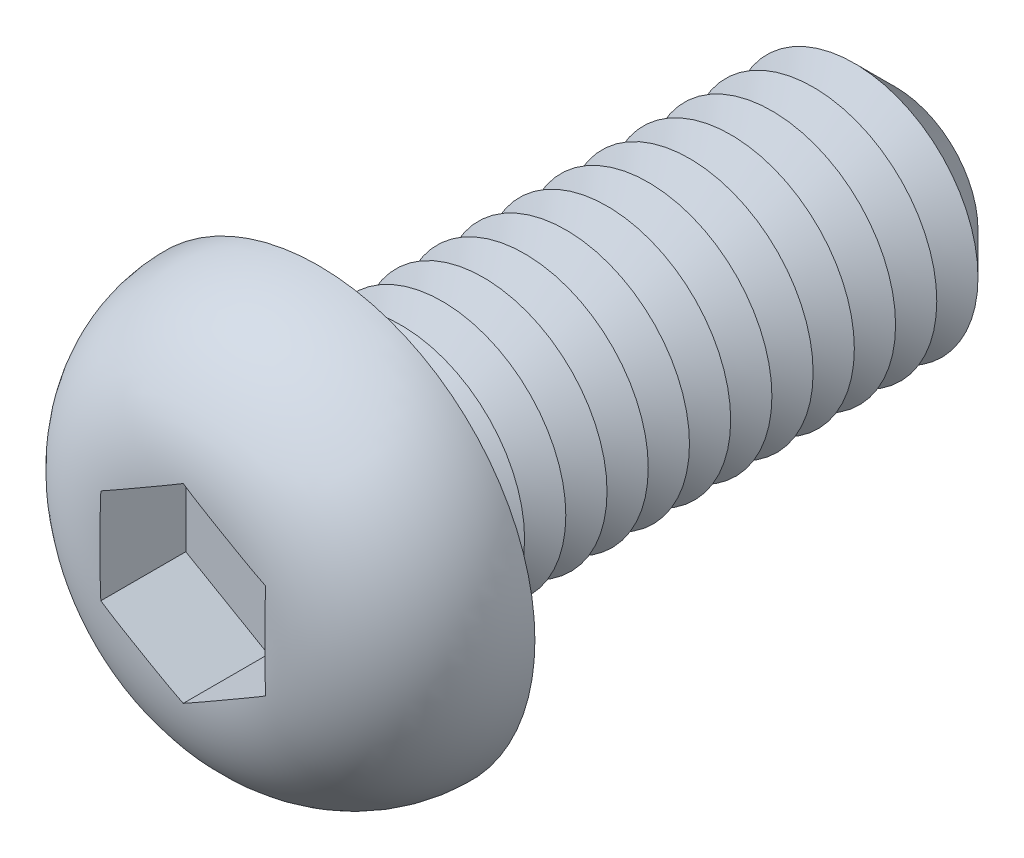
ISO-10303-21;
HEADER;
FILE_DESCRIPTION(('STEP AP214'),'2;1');
FILE_NAME('part.step','',(''),(''),'','','');
FILE_SCHEMA(('AUTOMOTIVE_DESIGN { 1 0 10303 214 1 1 1 1 }'));
ENDSEC;
DATA;
#1=APPLICATION_CONTEXT('core data for automotive mechanical design processes');
#2=APPLICATION_PROTOCOL_DEFINITION('international standard','automotive_design',2000,#1);
#3=PRODUCT_CONTEXT('',#1,'mechanical');
#4=PRODUCT('Part','Part','',(#3));
#5=PRODUCT_RELATED_PRODUCT_CATEGORY('part','',(#4));
#6=PRODUCT_DEFINITION_FORMATION('','',#4);
#7=PRODUCT_DEFINITION_CONTEXT('part definition',#1,'design');
#8=PRODUCT_DEFINITION('design','',#6,#7);
#9=PRODUCT_DEFINITION_SHAPE('','',#8);
#10=(LENGTH_UNIT() NAMED_UNIT(*) SI_UNIT(.MILLI.,.METRE.));
#11=(NAMED_UNIT(*) PLANE_ANGLE_UNIT() SI_UNIT($,.RADIAN.));
#12=(NAMED_UNIT(*) SI_UNIT($,.STERADIAN.) SOLID_ANGLE_UNIT());
#13=UNCERTAINTY_MEASURE_WITH_UNIT(LENGTH_MEASURE(1.E-05),#10,'distance_accuracy_value','');
#14=(GEOMETRIC_REPRESENTATION_CONTEXT(3) GLOBAL_UNCERTAINTY_ASSIGNED_CONTEXT((#13)) GLOBAL_UNIT_ASSIGNED_CONTEXT((#10,
#11,#12)) REPRESENTATION_CONTEXT('',''));
#15=CARTESIAN_POINT('',(0.,0.,0.));
#16=DIRECTION('',(0.,0.,1.));
#17=DIRECTION('',(1.,0.,0.));
#18=AXIS2_PLACEMENT_3D('',#15,#16,#17);
#19=CARTESIAN_POINT('',(0.,0.,-14.));
#20=DIRECTION('',(0.,0.,1.));
#21=DIRECTION('',(1.,0.,0.));
#22=AXIS2_PLACEMENT_3D('',#19,#20,#21);
#23=CYLINDRICAL_SURFACE('',#22,3.);
#24=CARTESIAN_POINT('',(0.,0.,-0.5));
#25=DIRECTION('',(0.,0.,1.));
#26=DIRECTION('',(1.,0.,0.));
#27=AXIS2_PLACEMENT_3D('',#24,#25,#26);
#28=CIRCLE('',#27,3.);
#29=CARTESIAN_POINT('',(3.,0.,-0.5));
#30=VERTEX_POINT('',#29);
#31=EDGE_CURVE('E48',#30,#30,#28,.F.);
#32=ORIENTED_EDGE('',*,*,#31,.T.);
#33=EDGE_LOOP('',(#32));
#34=FACE_BOUND('',#33,.T.);
#35=CARTESIAN_POINT('',(0.,0.,-1.));
#36=DIRECTION('',(0.,0.,1.));
#37=DIRECTION('',(1.,0.,0.));
#38=AXIS2_PLACEMENT_3D('',#35,#36,#37);
#39=CIRCLE('',#38,3.);
#40=CARTESIAN_POINT('',(3.,0.,-1.));
#41=VERTEX_POINT('',#40);
#42=EDGE_CURVE('E118',#41,#41,#39,.T.);
#43=ORIENTED_EDGE('',*,*,#42,.T.);
#44=EDGE_LOOP('',(#43));
#45=FACE_BOUND('',#44,.T.);
#46=ADVANCED_FACE('F39',(#34,#45),#23,.T.);
#47=CARTESIAN_POINT('',(0.,5.25,0.));
#48=DIRECTION('',(0.,0.,1.));
#49=DIRECTION('',(1.,0.,0.));
#50=AXIS2_PLACEMENT_3D('',#47,#48,#49);
#51=PLANE('',#50);
#52=CARTESIAN_POINT('',(0.,0.,0.));
#53=DIRECTION('',(0.,0.,1.));
#54=DIRECTION('',(1.,0.,0.));
#55=AXIS2_PLACEMENT_3D('',#52,#53,#54);
#56=CIRCLE('',#55,3.5);
#57=CARTESIAN_POINT('',(3.5,0.,0.));
#58=VERTEX_POINT('',#57);
#59=EDGE_CURVE('E11',#58,#58,#56,.T.);
#60=ORIENTED_EDGE('',*,*,#59,.T.);
#61=EDGE_LOOP('',(#60));
#62=FACE_BOUND('',#61,.T.);
#63=CARTESIAN_POINT('',(0.,0.,0.));
#64=DIRECTION('',(0.,0.,1.));
#65=DIRECTION('',(1.,0.,0.));
#66=AXIS2_PLACEMENT_3D('',#63,#64,#65);
#67=CIRCLE('',#66,5.25);
#68=CARTESIAN_POINT('',(5.25,0.,0.));
#69=VERTEX_POINT('',#68);
#70=EDGE_CURVE('E142',#69,#69,#67,.T.);
#71=ORIENTED_EDGE('',*,*,#70,.F.);
#72=EDGE_LOOP('',(#71));
#73=FACE_BOUND('',#72,.T.);
#74=ADVANCED_FACE('F219',(#62,#73),#51,.F.);
#75=CARTESIAN_POINT('',(0.,0.,0.));
#76=DIRECTION('',(0.,0.,1.));
#77=DIRECTION('',(1.,0.,0.));
#78=AXIS2_PLACEMENT_3D('',#75,#76,#77);
#79=DEGENERATE_TOROIDAL_SURFACE('',#78,1.95,3.3,.T.);
#80=CARTESIAN_POINT('',(-2.0002,1.15458506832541,3.28035788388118));
#81=CARTESIAN_POINT('',(-1.91691288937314,1.20267090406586,3.28561413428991));
#82=CARTESIAN_POINT('',(-1.83357497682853,1.25078607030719,3.2893341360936));
#83=CARTESIAN_POINT('',(-1.66686712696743,1.34703489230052,3.29467873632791));
#84=CARTESIAN_POINT('',(-1.58349720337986,1.39516854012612,3.29630387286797));
#85=CARTESIAN_POINT('',(-1.4167768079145,1.49142460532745,3.29843721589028));
#86=CARTESIAN_POINT('',(-1.33342633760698,1.53954702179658,3.29894575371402));
#87=CARTESIAN_POINT('',(-1.16671724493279,1.63579656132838,3.29953775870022));
#88=CARTESIAN_POINT('',(-1.0833586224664,1.68392368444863,3.29962119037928));
#89=CARTESIAN_POINT('',(-0.916641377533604,1.78017793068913,3.29962119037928));
#90=CARTESIAN_POINT('',(-0.833282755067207,1.82830505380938,3.29953775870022));
#91=CARTESIAN_POINT('',(-0.666573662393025,1.92455459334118,3.29894575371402));
#92=CARTESIAN_POINT('',(-0.5832231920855,1.97267700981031,3.29843721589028));
#93=CARTESIAN_POINT('',(-0.416502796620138,2.06893307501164,3.29630387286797));
#94=CARTESIAN_POINT('',(-0.333132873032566,2.11706672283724,3.29467873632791));
#95=CARTESIAN_POINT('',(-0.166425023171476,2.21331554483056,3.2893341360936));
#96=CARTESIAN_POINT('',(-0.083087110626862,2.2614307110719,3.28561413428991));
#97=CARTESIAN_POINT('',(0.000200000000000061,2.30951654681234,3.28035788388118));
#98=B_SPLINE_CURVE_WITH_KNOTS('',3,(#80,#81,#82,#83,#84,#85,#86,#87,#88,#89,#90,#91,#92,#93,#94,
#95,#96,#97),.UNSPECIFIED.,.F.,.F.,(4,2,2,2,2,2,2,2,4),(0.,0.288898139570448,0.577722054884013,
0.866460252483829,1.15522255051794,1.44398484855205,1.73272304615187,2.02154696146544,
2.31044510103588),.UNSPECIFIED.);
#99=CARTESIAN_POINT('',(-2.,1.15470053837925,3.28037053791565));
#100=VERTEX_POINT('',#99);
#101=CARTESIAN_POINT('',(0.,2.3094010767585,3.28037053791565));
#102=VERTEX_POINT('',#101);
#103=EDGE_CURVE('E159',#100,#102,#98,.T.);
#104=ORIENTED_EDGE('',*,*,#103,.T.);
#105=CARTESIAN_POINT('',(-0.000199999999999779,2.30951654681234,3.28035788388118));
#106=CARTESIAN_POINT('',(0.0830871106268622,2.2614307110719,3.28561413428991));
#107=CARTESIAN_POINT('',(0.166425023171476,2.21331554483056,3.2893341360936));
#108=CARTESIAN_POINT('',(0.333132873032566,2.11706672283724,3.29467873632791));
#109=CARTESIAN_POINT('',(0.416502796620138,2.06893307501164,3.29630387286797));
#110=CARTESIAN_POINT('',(0.5832231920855,1.97267700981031,3.29843721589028));
#111=CARTESIAN_POINT('',(0.666573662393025,1.92455459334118,3.29894575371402));
#112=CARTESIAN_POINT('',(0.833282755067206,1.82830505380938,3.29953775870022));
#113=CARTESIAN_POINT('',(0.916641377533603,1.78017793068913,3.29962119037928));
#114=CARTESIAN_POINT('',(1.0833586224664,1.68392368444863,3.29962119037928));
#115=CARTESIAN_POINT('',(1.16671724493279,1.63579656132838,3.29953775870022));
#116=CARTESIAN_POINT('',(1.33342633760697,1.53954702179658,3.29894575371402));
#117=CARTESIAN_POINT('',(1.4167768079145,1.49142460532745,3.29843721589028));
#118=CARTESIAN_POINT('',(1.58349720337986,1.39516854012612,3.29630387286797));
#119=CARTESIAN_POINT('',(1.66686712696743,1.34703489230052,3.29467873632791));
#120=CARTESIAN_POINT('',(1.83357497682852,1.25078607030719,3.2893341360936));
#121=CARTESIAN_POINT('',(1.91691288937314,1.20267090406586,3.28561413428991));
#122=CARTESIAN_POINT('',(2.0002,1.15458506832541,3.28035788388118));
#123=B_SPLINE_CURVE_WITH_KNOTS('',3,(#105,#106,#107,#108,#109,#110,#111,#112,#113,#114,#115,
#116,#117,#118,#119,#120,#121,#122),.UNSPECIFIED.,.F.,.F.,(4,2,2,2,2,2,2,2,4),(0.,
0.288898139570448,0.577722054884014,0.866460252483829,1.15522255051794,1.44398484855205,
1.73272304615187,2.02154696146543,2.31044510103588),.UNSPECIFIED.);
#124=CARTESIAN_POINT('',(2.,1.15470053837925,3.28037053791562));
#125=VERTEX_POINT('',#124);
#126=EDGE_CURVE('E98',#102,#125,#123,.T.);
#127=ORIENTED_EDGE('',*,*,#126,.T.);
#128=CARTESIAN_POINT('',(2.,0.,3.29962119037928));
#129=CARTESIAN_POINT('',(2.,-0.083776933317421,3.29962202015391));
#130=CARTESIAN_POINT('',(2.,-0.16755385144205,3.29955399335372));
#131=CARTESIAN_POINT('',(2.,-0.335108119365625,3.29913665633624));
#132=CARTESIAN_POINT('',(2.,-0.418885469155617,3.29878734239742));
#133=CARTESIAN_POINT('',(2.,-0.58647412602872,3.29739645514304));
#134=CARTESIAN_POINT('',(2.,-0.670285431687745,3.29635457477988));
#135=CARTESIAN_POINT('',(2.,-0.83788107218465,3.29299045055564));
#136=CARTESIAN_POINT('',(2.,-0.921665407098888,3.29066821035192));
#137=CARTESIAN_POINT('',(2.,-1.1722454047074,3.2807858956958));
#138=CARTESIAN_POINT('',(2.,-1.33895832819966,3.27031526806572));
#139=CARTESIAN_POINT('',(2.,-1.67103623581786,3.23635494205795));
#140=CARTESIAN_POINT('',(2.,-1.83640244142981,3.21287879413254));
#141=CARTESIAN_POINT('',(2.,-2.10344176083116,3.16074182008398));
#142=CARTESIAN_POINT('',(2.,-2.2061099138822,3.13718731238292));
#143=CARTESIAN_POINT('',(2.,-2.40948794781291,3.08263206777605));
#144=CARTESIAN_POINT('',(2.,-2.51019754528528,3.05163026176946));
#145=CARTESIAN_POINT('',(2.,-2.70894468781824,2.98167613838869));
#146=CARTESIAN_POINT('',(2.,-2.80697949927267,2.94271600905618));
#147=CARTESIAN_POINT('',(2.,-2.9994014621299,2.85662314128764));
#148=CARTESIAN_POINT('',(2.,-3.09378880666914,2.80949083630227));
#149=CARTESIAN_POINT('',(2.,-3.27874879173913,2.70660110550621));
#150=CARTESIAN_POINT('',(2.,-3.36928473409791,2.6507774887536));
#151=CARTESIAN_POINT('',(2.,-3.54476824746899,2.53095107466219));
#152=CARTESIAN_POINT('',(2.,-3.6297163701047,2.46694908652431));
#153=CARTESIAN_POINT('',(2.,-3.79309021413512,2.33110056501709));
#154=CARTESIAN_POINT('',(2.,-3.87151694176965,2.25925524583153));
#155=CARTESIAN_POINT('',(2.,-4.02093628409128,2.10826339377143));
#156=CARTESIAN_POINT('',(2.,-4.09192987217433,2.02911781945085));
#157=CARTESIAN_POINT('',(2.,-4.27732278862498,1.8003635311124));
#158=CARTESIAN_POINT('',(2.,-4.38297261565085,1.64348590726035));
#159=CARTESIAN_POINT('',(2.,-4.564185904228,1.31336862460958));
#160=CARTESIAN_POINT('',(2.,-4.63976443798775,1.14013721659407));
#161=CARTESIAN_POINT('',(2.,-4.75417820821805,0.794488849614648));
#162=CARTESIAN_POINT('',(2.,-4.79509243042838,0.622758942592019));
#163=CARTESIAN_POINT('',(2.,-4.84679751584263,0.274828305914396));
#164=CARTESIAN_POINT('',(2.,-4.85759267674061,0.098628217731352));
#165=CARTESIAN_POINT('',(2.,-4.8487955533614,-0.249157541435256));
#166=CARTESIAN_POINT('',(2.,-4.82985906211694,-0.420760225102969));
#167=CARTESIAN_POINT('',(2.,-4.76345103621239,-0.758322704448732));
#168=CARTESIAN_POINT('',(2.,-4.71598351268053,-0.924283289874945));
#169=CARTESIAN_POINT('',(2.,-4.59404942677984,-1.24604183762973));
#170=CARTESIAN_POINT('',(2.,-4.51956988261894,-1.40183487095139));
#171=CARTESIAN_POINT('',(2.,-4.34600859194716,-1.6990817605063));
#172=CARTESIAN_POINT('',(2.,-4.24691988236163,-1.84053154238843));
#173=CARTESIAN_POINT('',(2.,-4.02493220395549,-2.10847549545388));
#174=CARTESIAN_POINT('',(2.,-3.90156532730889,-2.23458080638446));
#175=CARTESIAN_POINT('',(2.,-3.63636218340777,-2.46550695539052));
#176=CARTESIAN_POINT('',(2.,-3.49453117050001,-2.57033382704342));
#177=CARTESIAN_POINT('',(2.,-3.26713798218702,-2.7130834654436));
#178=CARTESIAN_POINT('',(2.,-3.18660091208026,-2.75923686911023));
#179=CARTESIAN_POINT('',(2.,-3.02216370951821,-2.84520816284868));
#180=CARTESIAN_POINT('',(2.,-2.93826250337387,-2.88502400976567));
#181=CARTESIAN_POINT('',(2.,-2.76779132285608,-2.95832456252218));
#182=CARTESIAN_POINT('',(2.,-2.68122238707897,-2.99181169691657));
#183=CARTESIAN_POINT('',(2.,-2.50604626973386,-3.05263810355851));
#184=CARTESIAN_POINT('',(2.,-2.41744088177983,-3.07998257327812));
#185=CARTESIAN_POINT('',(2.,-2.20396420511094,-3.13835394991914));
#186=CARTESIAN_POINT('',(2.,-2.07835656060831,-3.16669536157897));
#187=CARTESIAN_POINT('',(2.,-1.82529007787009,-3.2134938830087));
#188=CARTESIAN_POINT('',(2.,-1.69783012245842,-3.23194474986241));
#189=CARTESIAN_POINT('',(2.,-1.44149598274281,-3.26083645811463));
#190=CARTESIAN_POINT('',(2.,-1.31261808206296,-3.27124272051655));
#191=CARTESIAN_POINT('',(2.,-1.05456848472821,-3.28623769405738));
#192=CARTESIAN_POINT('',(2.,-0.925396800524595,-3.29082664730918));
#193=CARTESIAN_POINT('',(2.,-0.665550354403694,-3.29674923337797));
#194=CARTESIAN_POINT('',(2.,-0.53487497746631,-3.29804579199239));
#195=CARTESIAN_POINT('',(2.,-0.273526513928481,-3.29947536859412));
#196=CARTESIAN_POINT('',(2.,-0.142853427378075,-3.29960842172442));
#197=CARTESIAN_POINT('',(2.,0.118243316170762,-3.29963281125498));
#198=CARTESIAN_POINT('',(2.,0.248666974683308,-3.29952460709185));
#199=CARTESIAN_POINT('',(2.,0.509509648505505,-3.29825409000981));
#200=CARTESIAN_POINT('',(2.,0.639928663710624,-3.29709183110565));
#201=CARTESIAN_POINT('',(2.,0.831730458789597,-3.29304171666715));
#202=CARTESIAN_POINT('',(2.,0.89313616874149,-3.29139197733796));
#203=CARTESIAN_POINT('',(2.,1.01591282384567,-3.28711504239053));
#204=CARTESIAN_POINT('',(2.,1.07728376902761,-3.28448784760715));
#205=CARTESIAN_POINT('',(2.,1.26131335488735,-3.27473407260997));
#206=CARTESIAN_POINT('',(2.,1.38388698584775,-3.2657353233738));
#207=CARTESIAN_POINT('',(2.,1.62750125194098,-3.24079239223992));
#208=CARTESIAN_POINT('',(2.,1.74854662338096,-3.22489680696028));
#209=CARTESIAN_POINT('',(2.,1.98924449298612,-3.18452451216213));
#210=CARTESIAN_POINT('',(2.,2.10889688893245,-3.16004717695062));
#211=CARTESIAN_POINT('',(2.,2.34827145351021,-3.10067973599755));
#212=CARTESIAN_POINT('',(2.,2.46794336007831,-3.06558373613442));
#213=CARTESIAN_POINT('',(2.,2.70350765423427,-2.98433995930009));
#214=CARTESIAN_POINT('',(2.,2.8194000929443,-2.9381923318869));
#215=CARTESIAN_POINT('',(2.,3.0462872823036,-2.83430045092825));
#216=CARTESIAN_POINT('',(2.,3.157267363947,-2.77652399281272));
#217=CARTESIAN_POINT('',(2.,3.37244069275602,-2.64945989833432));
#218=CARTESIAN_POINT('',(2.,3.47663511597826,-2.58017426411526));
#219=CARTESIAN_POINT('',(2.,3.66184410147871,-2.44158969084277));
#220=CARTESIAN_POINT('',(2.,3.74400419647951,-2.37381785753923));
#221=CARTESIAN_POINT('',(2.,3.90136233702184,-2.23063102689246));
#222=CARTESIAN_POINT('',(2.,3.9765614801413,-2.1552172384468));
#223=CARTESIAN_POINT('',(2.,4.11902811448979,-1.99742327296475));
#224=CARTESIAN_POINT('',(2.,4.18630715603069,-1.91505354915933));
#225=CARTESIAN_POINT('',(2.,4.31224227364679,-1.74401295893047));
#226=CARTESIAN_POINT('',(2.,4.37089943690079,-1.65534288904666));
#227=CARTESIAN_POINT('',(2.,4.51742320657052,-1.40720395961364));
#228=CARTESIAN_POINT('',(2.,4.59632371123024,-1.24230503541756));
#229=CARTESIAN_POINT('',(2.,4.72377654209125,-0.901269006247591));
#230=CARTESIAN_POINT('',(2.,4.77233626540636,-0.725134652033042));
#231=CARTESIAN_POINT('',(2.,4.83594291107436,-0.375162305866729));
#232=CARTESIAN_POINT('',(2.,4.85240855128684,-0.201581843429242));
#233=CARTESIAN_POINT('',(2.,4.85558073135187,0.145835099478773));
#234=CARTESIAN_POINT('',(2.,4.8422910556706,0.319671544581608));
#235=CARTESIAN_POINT('',(2.,4.78674180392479,0.660539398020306));
#236=CARTESIAN_POINT('',(2.,4.74482430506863,0.827626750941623));
#237=CARTESIAN_POINT('',(2.,4.63375789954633,1.15246461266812));
#238=CARTESIAN_POINT('',(2.,4.56461058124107,1.31021566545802));
#239=CARTESIAN_POINT('',(2.,4.40063624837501,1.61344814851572));
#240=CARTESIAN_POINT('',(2.,4.30559842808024,1.75881539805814));
#241=CARTESIAN_POINT('',(2.,4.09315528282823,2.03216183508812));
#242=CARTESIAN_POINT('',(2.,3.97574503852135,2.16013718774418));
#243=CARTESIAN_POINT('',(2.,3.71810418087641,2.3997527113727));
#244=CARTESIAN_POINT('',(2.,3.57725563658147,2.51072635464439));
#245=CARTESIAN_POINT('',(2.,3.28005668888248,2.70933274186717));
#246=CARTESIAN_POINT('',(2.,3.12370896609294,2.79696951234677));
#247=CARTESIAN_POINT('',(2.,2.85462284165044,2.92305372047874));
#248=CARTESIAN_POINT('',(2.,2.74490899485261,2.96813077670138));
#249=CARTESIAN_POINT('',(2.,2.52184151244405,3.04824715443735));
#250=CARTESIAN_POINT('',(2.,2.40848685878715,3.08328364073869));
#251=CARTESIAN_POINT('',(2.,2.17918323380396,3.14397693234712));
#252=CARTESIAN_POINT('',(2.,2.06323128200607,3.16962230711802));
#253=CARTESIAN_POINT('',(2.,1.82982653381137,3.21251895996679));
#254=CARTESIAN_POINT('',(2.,1.71237385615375,3.229770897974));
#255=CARTESIAN_POINT('',(2.,1.46252543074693,3.2589582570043));
#256=CARTESIAN_POINT('',(2.,1.3300298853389,3.27000580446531));
#257=CARTESIAN_POINT('',(2.,1.0646774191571,3.28585371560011));
#258=CARTESIAN_POINT('',(2.,0.931820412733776,3.29065244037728));
#259=CARTESIAN_POINT('',(2.,0.665789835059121,3.29677132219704));
#260=CARTESIAN_POINT('',(2.,0.532616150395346,3.29808470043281));
#261=CARTESIAN_POINT('',(2.,0.332868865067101,3.29913679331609));
#262=CARTESIAN_POINT('',(2.,0.266295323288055,3.2993345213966));
#263=CARTESIAN_POINT('',(2.,0.133147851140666,3.29957639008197));
#264=CARTESIAN_POINT('',(2.,0.0665739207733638,3.29962053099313));
#265=CARTESIAN_POINT('',(2.,0.,3.29962119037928));
#266=B_SPLINE_CURVE_WITH_KNOTS('',3,(#128,#129,#130,#131,#132,#133,#134,#135,#136,#137,#138,
#139,#140,#141,#142,#143,#144,#145,#146,#147,#148,#149,#150,#151,#152,#153,#154,#155,#156,#157,
#158,#159,#160,#161,#162,#163,#164,#165,#166,#167,#168,#169,#170,#171,#172,#173,#174,#175,#176,
#177,#178,#179,#180,#181,#182,#183,#184,#185,#186,#187,#188,#189,#190,#191,#192,#193,#194,#195,
#196,#197,#198,#199,#200,#201,#202,#203,#204,#205,#206,#207,#208,#209,#210,#211,#212,#213,#214,
#215,#216,#217,#218,#219,#220,#221,#222,#223,#224,#225,#226,#227,#228,#229,#230,#231,#232,#233,
#234,#235,#236,#237,#238,#239,#240,#241,#242,#243,#244,#245,#246,#247,#248,#249,#250,#251,#252,
#253,#254,#255,#256,#257,#258,#259,#260,#261,#262,#263,#264,#265),.UNSPECIFIED.,.T.,.F.,(4,2,2,
2,2,2,2,2,2,2,2,2,2,2,2,2,2,2,2,2,2,2,2,2,2,2,2,2,2,2,2,2,2,2,2,2,2,2,2,2,2,2,2,2,2,2,2,2,2,2,2,
2,2,2,2,2,2,2,2,2,2,2,2,2,2,2,2,2,4),(0.,0.251330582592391,0.502664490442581,0.754109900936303,
1.00555459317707,1.50637447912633,2.00667353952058,2.32243701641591,2.63824585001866,
2.95436618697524,3.27046976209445,3.58911045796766,3.90771965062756,4.22627959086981,
4.5447977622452,5.10896009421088,5.67283930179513,6.19985685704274,6.72679920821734,
7.24228104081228,7.75769041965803,8.27334782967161,8.78915130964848,9.3160918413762,
9.84288274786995,10.1211212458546,10.3994492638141,10.6776702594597,10.9556549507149,
11.3414617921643,11.727511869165,12.1152122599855,12.5028965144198,12.8949273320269,
13.2869463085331,13.6782193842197,14.0694724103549,14.2537488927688,14.4380252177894,
14.8065831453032,15.1725852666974,15.5386140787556,15.9122523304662,16.28588552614,
16.6605680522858,17.0351854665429,17.3542226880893,17.6732095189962,17.9917252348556,
18.3102007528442,18.8555909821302,19.4008481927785,19.9214008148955,20.4418872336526,
20.9562606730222,21.4706041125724,21.9892675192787,22.5080451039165,23.0436926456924,
23.5792477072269,23.9346277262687,24.2901079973,24.6460195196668,25.0019030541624,
25.4005476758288,25.7992968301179,26.1988209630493,26.3985429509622,26.5982645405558),.UNSPECIFIED.);
#267=CARTESIAN_POINT('',(2.,-1.15470053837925,3.28037053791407));
#268=VERTEX_POINT('',#267);
#269=EDGE_CURVE('E63',#125,#268,#266,.T.);
#270=ORIENTED_EDGE('',*,*,#269,.T.);
#271=CARTESIAN_POINT('',(2.0002,-1.15458506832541,3.28035788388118));
#272=CARTESIAN_POINT('',(1.91691288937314,-1.20267090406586,3.28561413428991));
#273=CARTESIAN_POINT('',(1.83357497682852,-1.25078607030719,3.2893341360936));
#274=CARTESIAN_POINT('',(1.66686712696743,-1.34703489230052,3.29467873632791));
#275=CARTESIAN_POINT('',(1.58349720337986,-1.39516854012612,3.29630387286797));
#276=CARTESIAN_POINT('',(1.4167768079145,-1.49142460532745,3.29843721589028));
#277=CARTESIAN_POINT('',(1.33342633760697,-1.53954702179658,3.29894575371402));
#278=CARTESIAN_POINT('',(1.16671724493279,-1.63579656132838,3.29953775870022));
#279=CARTESIAN_POINT('',(1.0833586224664,-1.68392368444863,3.29962119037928));
#280=CARTESIAN_POINT('',(0.916641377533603,-1.78017793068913,3.29962119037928));
#281=CARTESIAN_POINT('',(0.833282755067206,-1.82830505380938,3.29953775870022));
#282=CARTESIAN_POINT('',(0.666573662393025,-1.92455459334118,3.29894575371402));
#283=CARTESIAN_POINT('',(0.5832231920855,-1.97267700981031,3.29843721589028));
#284=CARTESIAN_POINT('',(0.416502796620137,-2.06893307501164,3.29630387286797));
#285=CARTESIAN_POINT('',(0.333132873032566,-2.11706672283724,3.29467873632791));
#286=CARTESIAN_POINT('',(0.166425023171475,-2.21331554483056,3.2893341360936));
#287=CARTESIAN_POINT('',(0.0830871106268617,-2.2614307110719,3.28561413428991));
#288=CARTESIAN_POINT('',(-0.000200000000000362,-2.30951654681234,3.28035788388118));
#289=B_SPLINE_CURVE_WITH_KNOTS('',3,(#271,#272,#273,#274,#275,#276,#277,#278,#279,#280,#281,
#282,#283,#284,#285,#286,#287,#288),.UNSPECIFIED.,.F.,.F.,(4,2,2,2,2,2,2,2,4),(0.,
0.288898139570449,0.577722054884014,0.86646025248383,1.15522255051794,1.44398484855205,
1.73272304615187,2.02154696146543,2.31044510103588),.UNSPECIFIED.);
#290=CARTESIAN_POINT('',(0.,-2.3094010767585,3.28037053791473));
#291=VERTEX_POINT('',#290);
#292=EDGE_CURVE('E240',#268,#291,#289,.T.);
#293=ORIENTED_EDGE('',*,*,#292,.T.);
#294=CARTESIAN_POINT('',(0.000199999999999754,-2.30951654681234,3.28035788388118));
#295=CARTESIAN_POINT('',(-0.0830871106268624,-2.2614307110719,3.28561413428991));
#296=CARTESIAN_POINT('',(-0.166425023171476,-2.21331554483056,3.2893341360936));
#297=CARTESIAN_POINT('',(-0.333132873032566,-2.11706672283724,3.29467873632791));
#298=CARTESIAN_POINT('',(-0.416502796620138,-2.06893307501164,3.29630387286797));
#299=CARTESIAN_POINT('',(-0.5832231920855,-1.97267700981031,3.29843721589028));
#300=CARTESIAN_POINT('',(-0.666573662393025,-1.92455459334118,3.29894575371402));
#301=CARTESIAN_POINT('',(-0.833282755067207,-1.82830505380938,3.29953775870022));
#302=CARTESIAN_POINT('',(-0.916641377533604,-1.78017793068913,3.29962119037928));
#303=CARTESIAN_POINT('',(-1.0833586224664,-1.68392368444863,3.29962119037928));
#304=CARTESIAN_POINT('',(-1.16671724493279,-1.63579656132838,3.29953775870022));
#305=CARTESIAN_POINT('',(-1.33342633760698,-1.53954702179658,3.29894575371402));
#306=CARTESIAN_POINT('',(-1.4167768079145,-1.49142460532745,3.29843721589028));
#307=CARTESIAN_POINT('',(-1.58349720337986,-1.39516854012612,3.29630387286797));
#308=CARTESIAN_POINT('',(-1.66686712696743,-1.34703489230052,3.29467873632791));
#309=CARTESIAN_POINT('',(-1.83357497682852,-1.25078607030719,3.2893341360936));
#310=CARTESIAN_POINT('',(-1.91691288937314,-1.20267090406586,3.28561413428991));
#311=CARTESIAN_POINT('',(-2.0002,-1.15458506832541,3.28035788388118));
#312=B_SPLINE_CURVE_WITH_KNOTS('',3,(#294,#295,#296,#297,#298,#299,#300,#301,#302,#303,#304,
#305,#306,#307,#308,#309,#310,#311),.UNSPECIFIED.,.F.,.F.,(4,2,2,2,2,2,2,2,4),(0.,
0.288898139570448,0.577722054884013,0.866460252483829,1.15522255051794,1.44398484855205,
1.73272304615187,2.02154696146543,2.31044510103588),.UNSPECIFIED.);
#313=CARTESIAN_POINT('',(-2.,-1.15470053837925,3.28037053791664));
#314=VERTEX_POINT('',#313);
#315=EDGE_CURVE('E246',#291,#314,#312,.T.);
#316=ORIENTED_EDGE('',*,*,#315,.T.);
#317=CARTESIAN_POINT('',(-2.,0.,3.29962119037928));
#318=CARTESIAN_POINT('',(-2.,0.083776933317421,3.29962202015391));
#319=CARTESIAN_POINT('',(-2.,0.16755385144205,3.29955399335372));
#320=CARTESIAN_POINT('',(-2.,0.335108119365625,3.29913665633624));
#321=CARTESIAN_POINT('',(-2.,0.418885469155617,3.29878734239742));
#322=CARTESIAN_POINT('',(-2.,0.58647412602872,3.29739645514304));
#323=CARTESIAN_POINT('',(-2.,0.670285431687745,3.29635457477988));
#324=CARTESIAN_POINT('',(-2.,0.83788107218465,3.29299045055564));
#325=CARTESIAN_POINT('',(-2.,0.921665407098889,3.29066821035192));
#326=CARTESIAN_POINT('',(-2.,1.1722454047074,3.2807858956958));
#327=CARTESIAN_POINT('',(-2.,1.33895832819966,3.27031526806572));
#328=CARTESIAN_POINT('',(-2.,1.67103623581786,3.23635494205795));
#329=CARTESIAN_POINT('',(-2.,1.83640244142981,3.21287879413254));
#330=CARTESIAN_POINT('',(-2.,2.10344176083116,3.16074182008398));
#331=CARTESIAN_POINT('',(-2.,2.2061099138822,3.13718731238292));
#332=CARTESIAN_POINT('',(-2.,2.40948794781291,3.08263206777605));
#333=CARTESIAN_POINT('',(-2.,2.51019754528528,3.05163026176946));
#334=CARTESIAN_POINT('',(-2.,2.70894468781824,2.98167613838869));
#335=CARTESIAN_POINT('',(-2.,2.80697949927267,2.94271600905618));
#336=CARTESIAN_POINT('',(-2.,2.9994014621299,2.85662314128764));
#337=CARTESIAN_POINT('',(-2.,3.09378880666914,2.80949083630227));
#338=CARTESIAN_POINT('',(-2.,3.27874879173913,2.70660110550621));
#339=CARTESIAN_POINT('',(-2.,3.36928473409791,2.6507774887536));
#340=CARTESIAN_POINT('',(-2.,3.54476824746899,2.53095107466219));
#341=CARTESIAN_POINT('',(-2.,3.6297163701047,2.46694908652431));
#342=CARTESIAN_POINT('',(-2.,3.79309021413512,2.33110056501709));
#343=CARTESIAN_POINT('',(-2.,3.87151694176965,2.25925524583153));
#344=CARTESIAN_POINT('',(-2.,4.02093628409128,2.10826339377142));
#345=CARTESIAN_POINT('',(-2.,4.09192987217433,2.02911781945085));
#346=CARTESIAN_POINT('',(-2.,4.27732278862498,1.8003635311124));
#347=CARTESIAN_POINT('',(-2.,4.38297261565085,1.64348590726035));
#348=CARTESIAN_POINT('',(-2.,4.564185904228,1.31336862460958));
#349=CARTESIAN_POINT('',(-2.,4.63976443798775,1.14013721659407));
#350=CARTESIAN_POINT('',(-2.,4.75417820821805,0.794488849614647));
#351=CARTESIAN_POINT('',(-2.,4.79509243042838,0.622758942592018));
#352=CARTESIAN_POINT('',(-2.,4.84679751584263,0.274828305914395));
#353=CARTESIAN_POINT('',(-2.,4.85759267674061,0.0986282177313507));
#354=CARTESIAN_POINT('',(-2.,4.8487955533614,-0.249157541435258));
#355=CARTESIAN_POINT('',(-2.,4.82985906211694,-0.42076022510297));
#356=CARTESIAN_POINT('',(-2.,4.76345103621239,-0.758322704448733));
#357=CARTESIAN_POINT('',(-2.,4.71598351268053,-0.924283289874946));
#358=CARTESIAN_POINT('',(-2.,4.59404942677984,-1.24604183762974));
#359=CARTESIAN_POINT('',(-2.,4.51956988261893,-1.40183487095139));
#360=CARTESIAN_POINT('',(-2.,4.34600859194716,-1.6990817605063));
#361=CARTESIAN_POINT('',(-2.,4.24691988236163,-1.84053154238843));
#362=CARTESIAN_POINT('',(-2.,4.02493220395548,-2.10847549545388));
#363=CARTESIAN_POINT('',(-2.,3.90156532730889,-2.23458080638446));
#364=CARTESIAN_POINT('',(-2.,3.63636218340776,-2.46550695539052));
#365=CARTESIAN_POINT('',(-2.,3.49453117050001,-2.57033382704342));
#366=CARTESIAN_POINT('',(-2.,3.26713798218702,-2.7130834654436));
#367=CARTESIAN_POINT('',(-2.,3.18660091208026,-2.75923686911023));
#368=CARTESIAN_POINT('',(-2.,3.02216370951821,-2.84520816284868));
#369=CARTESIAN_POINT('',(-2.,2.93826250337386,-2.88502400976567));
#370=CARTESIAN_POINT('',(-2.,2.76779132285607,-2.95832456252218));
#371=CARTESIAN_POINT('',(-2.,2.68122238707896,-2.99181169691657));
#372=CARTESIAN_POINT('',(-2.,2.50604626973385,-3.05263810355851));
#373=CARTESIAN_POINT('',(-2.,2.41744088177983,-3.07998257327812));
#374=CARTESIAN_POINT('',(-2.,2.20396420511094,-3.13835394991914));
#375=CARTESIAN_POINT('',(-2.,2.0783565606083,-3.16669536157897));
#376=CARTESIAN_POINT('',(-2.,1.82529007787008,-3.2134938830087));
#377=CARTESIAN_POINT('',(-2.,1.69783012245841,-3.23194474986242));
#378=CARTESIAN_POINT('',(-2.,1.4414959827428,-3.26083645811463));
#379=CARTESIAN_POINT('',(-2.,1.31261808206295,-3.27124272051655));
#380=CARTESIAN_POINT('',(-2.,1.0545684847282,-3.28623769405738));
#381=CARTESIAN_POINT('',(-2.,0.925396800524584,-3.29082664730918));
#382=CARTESIAN_POINT('',(-2.,0.665550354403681,-3.29674923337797));
#383=CARTESIAN_POINT('',(-2.,0.534874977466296,-3.29804579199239));
#384=CARTESIAN_POINT('',(-2.,0.273526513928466,-3.29947536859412));
#385=CARTESIAN_POINT('',(-2.,0.142853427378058,-3.29960842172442));
#386=CARTESIAN_POINT('',(-2.,-0.11824331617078,-3.29963281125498));
#387=CARTESIAN_POINT('',(-2.,-0.248666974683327,-3.29952460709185));
#388=CARTESIAN_POINT('',(-2.,-0.509509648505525,-3.29825409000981));
#389=CARTESIAN_POINT('',(-2.,-0.639928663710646,-3.29709183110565));
#390=CARTESIAN_POINT('',(-2.,-0.83173045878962,-3.29304171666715));
#391=CARTESIAN_POINT('',(-2.,-0.893136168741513,-3.29139197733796));
#392=CARTESIAN_POINT('',(-2.,-1.0159128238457,-3.28711504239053));
#393=CARTESIAN_POINT('',(-2.,-1.07728376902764,-3.28448784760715));
#394=CARTESIAN_POINT('',(-2.,-1.26131335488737,-3.27473407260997));
#395=CARTESIAN_POINT('',(-2.,-1.38388698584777,-3.2657353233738));
#396=CARTESIAN_POINT('',(-2.,-1.627501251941,-3.24079239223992));
#397=CARTESIAN_POINT('',(-2.,-1.74854662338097,-3.22489680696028));
#398=CARTESIAN_POINT('',(-2.,-1.98924449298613,-3.18452451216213));
#399=CARTESIAN_POINT('',(-2.,-2.10889688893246,-3.16004717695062));
#400=CARTESIAN_POINT('',(-2.,-2.34827145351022,-3.10067973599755));
#401=CARTESIAN_POINT('',(-2.,-2.46794336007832,-3.06558373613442));
#402=CARTESIAN_POINT('',(-2.,-2.70350765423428,-2.98433995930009));
#403=CARTESIAN_POINT('',(-2.,-2.81940009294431,-2.93819233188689));
#404=CARTESIAN_POINT('',(-2.,-3.0462872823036,-2.83430045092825));
#405=CARTESIAN_POINT('',(-2.,-3.157267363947,-2.77652399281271));
#406=CARTESIAN_POINT('',(-2.,-3.37244069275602,-2.64945989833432));
#407=CARTESIAN_POINT('',(-2.,-3.47663511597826,-2.58017426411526));
#408=CARTESIAN_POINT('',(-2.,-3.66184410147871,-2.44158969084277));
#409=CARTESIAN_POINT('',(-2.,-3.74400419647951,-2.37381785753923));
#410=CARTESIAN_POINT('',(-2.,-3.90136233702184,-2.23063102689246));
#411=CARTESIAN_POINT('',(-2.,-3.9765614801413,-2.1552172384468));
#412=CARTESIAN_POINT('',(-2.,-4.11902811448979,-1.99742327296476));
#413=CARTESIAN_POINT('',(-2.,-4.18630715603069,-1.91505354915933));
#414=CARTESIAN_POINT('',(-2.,-4.31224227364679,-1.74401295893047));
#415=CARTESIAN_POINT('',(-2.,-4.37089943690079,-1.65534288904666));
#416=CARTESIAN_POINT('',(-2.,-4.51742320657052,-1.40720395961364));
#417=CARTESIAN_POINT('',(-2.,-4.59632371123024,-1.24230503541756));
#418=CARTESIAN_POINT('',(-2.,-4.72377654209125,-0.901269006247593));
#419=CARTESIAN_POINT('',(-2.,-4.77233626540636,-0.725134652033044));
#420=CARTESIAN_POINT('',(-2.,-4.83594291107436,-0.37516230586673));
#421=CARTESIAN_POINT('',(-2.,-4.85240855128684,-0.201581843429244));
#422=CARTESIAN_POINT('',(-2.,-4.85558073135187,0.145835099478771));
#423=CARTESIAN_POINT('',(-2.,-4.8422910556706,0.319671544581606));
#424=CARTESIAN_POINT('',(-2.,-4.78674180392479,0.660539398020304));
#425=CARTESIAN_POINT('',(-2.,-4.74482430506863,0.827626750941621));
#426=CARTESIAN_POINT('',(-2.,-4.63375789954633,1.15246461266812));
#427=CARTESIAN_POINT('',(-2.,-4.56461058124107,1.31021566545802));
#428=CARTESIAN_POINT('',(-2.,-4.40063624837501,1.61344814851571));
#429=CARTESIAN_POINT('',(-2.,-4.30559842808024,1.75881539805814));
#430=CARTESIAN_POINT('',(-2.,-4.09315528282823,2.03216183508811));
#431=CARTESIAN_POINT('',(-2.,-3.97574503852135,2.16013718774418));
#432=CARTESIAN_POINT('',(-2.,-3.71810418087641,2.39975271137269));
#433=CARTESIAN_POINT('',(-2.,-3.57725563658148,2.51072635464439));
#434=CARTESIAN_POINT('',(-2.,-3.28005668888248,2.70933274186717));
#435=CARTESIAN_POINT('',(-2.,-3.12370896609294,2.79696951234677));
#436=CARTESIAN_POINT('',(-2.,-2.85462284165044,2.92305372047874));
#437=CARTESIAN_POINT('',(-2.,-2.74490899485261,2.96813077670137));
#438=CARTESIAN_POINT('',(-2.,-2.52184151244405,3.04824715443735));
#439=CARTESIAN_POINT('',(-2.,-2.40848685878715,3.08328364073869));
#440=CARTESIAN_POINT('',(-2.,-2.17918323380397,3.14397693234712));
#441=CARTESIAN_POINT('',(-2.,-2.06323128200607,3.16962230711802));
#442=CARTESIAN_POINT('',(-2.,-1.82982653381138,3.21251895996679));
#443=CARTESIAN_POINT('',(-2.,-1.71237385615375,3.229770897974));
#444=CARTESIAN_POINT('',(-2.,-1.46252543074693,3.2589582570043));
#445=CARTESIAN_POINT('',(-2.,-1.33002988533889,3.27000580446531));
#446=CARTESIAN_POINT('',(-2.,-1.0646774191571,3.28585371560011));
#447=CARTESIAN_POINT('',(-2.,-0.931820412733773,3.29065244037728));
#448=CARTESIAN_POINT('',(-2.,-0.66578983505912,3.29677132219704));
#449=CARTESIAN_POINT('',(-2.,-0.532616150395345,3.29808470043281));
#450=CARTESIAN_POINT('',(-2.,-0.332868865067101,3.29913679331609));
#451=CARTESIAN_POINT('',(-2.,-0.266295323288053,3.2993345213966));
#452=CARTESIAN_POINT('',(-2.,-0.133147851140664,3.29957639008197));
#453=CARTESIAN_POINT('',(-2.,-0.0665739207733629,3.29962053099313));
#454=CARTESIAN_POINT('',(-2.,0.,3.29962119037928));
#455=B_SPLINE_CURVE_WITH_KNOTS('',3,(#317,#318,#319,#320,#321,#322,#323,#324,#325,#326,#327,
#328,#329,#330,#331,#332,#333,#334,#335,#336,#337,#338,#339,#340,#341,#342,#343,#344,#345,#346,
#347,#348,#349,#350,#351,#352,#353,#354,#355,#356,#357,#358,#359,#360,#361,#362,#363,#364,#365,
#366,#367,#368,#369,#370,#371,#372,#373,#374,#375,#376,#377,#378,#379,#380,#381,#382,#383,#384,
#385,#386,#387,#388,#389,#390,#391,#392,#393,#394,#395,#396,#397,#398,#399,#400,#401,#402,#403,
#404,#405,#406,#407,#408,#409,#410,#411,#412,#413,#414,#415,#416,#417,#418,#419,#420,#421,#422,
#423,#424,#425,#426,#427,#428,#429,#430,#431,#432,#433,#434,#435,#436,#437,#438,#439,#440,#441,
#442,#443,#444,#445,#446,#447,#448,#449,#450,#451,#452,#453,#454),.UNSPECIFIED.,.T.,.F.,(4,2,2,
2,2,2,2,2,2,2,2,2,2,2,2,2,2,2,2,2,2,2,2,2,2,2,2,2,2,2,2,2,2,2,2,2,2,2,2,2,2,2,2,2,2,2,2,2,2,2,2,
2,2,2,2,2,2,2,2,2,2,2,2,2,2,2,2,2,4),(0.,0.251330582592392,0.502664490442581,0.754109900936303,
1.00555459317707,1.50637447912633,2.00667353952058,2.32243701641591,2.63824585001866,
2.95436618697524,3.27046976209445,3.58911045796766,3.90771965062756,4.22627959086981,
4.5447977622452,5.10896009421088,5.67283930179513,6.19985685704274,6.72679920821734,
7.24228104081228,7.75769041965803,8.27334782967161,8.78915130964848,9.3160918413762,
9.84288274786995,10.1211212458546,10.3994492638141,10.6776702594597,10.9556549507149,
11.3414617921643,11.727511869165,12.1152122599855,12.5028965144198,12.8949273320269,
13.2869463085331,13.6782193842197,14.0694724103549,14.2537488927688,14.4380252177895,
14.8065831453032,15.1725852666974,15.5386140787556,15.9122523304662,16.28588552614,
16.6605680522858,17.0351854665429,17.3542226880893,17.6732095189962,17.9917252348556,
18.3102007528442,18.8555909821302,19.4008481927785,19.9214008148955,20.4418872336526,
20.9562606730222,21.4706041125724,21.9892675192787,22.5080451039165,23.0436926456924,
23.5792477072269,23.9346277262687,24.2901079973,24.6460195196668,25.0019030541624,
25.4005476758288,25.7992968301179,26.1988209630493,26.3985429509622,26.5982645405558),.UNSPECIFIED.);
#456=EDGE_CURVE('E167',#314,#100,#455,.T.);
#457=ORIENTED_EDGE('',*,*,#456,.T.);
#458=EDGE_LOOP('',(#104,#127,#270,#293,#316,#457));
#459=FACE_BOUND('',#458,.T.);
#460=ORIENTED_EDGE('',*,*,#70,.T.);
#461=EDGE_LOOP('',(#460));
#462=FACE_BOUND('',#461,.T.);
#463=ADVANCED_FACE('F172',(#459,#462),#79,.T.);
#464=CARTESIAN_POINT('',(2.,1.15470053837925,1.22));
#465=DIRECTION('',(0.5,0.866025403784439,0.));
#466=DIRECTION('',(-0.866025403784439,0.5,0.));
#467=AXIS2_PLACEMENT_3D('',#464,#465,#466);
#468=PLANE('',#467);
#469=DIRECTION('',(0.,0.,1.));
#470=VECTOR('',#469,1.);
#471=CARTESIAN_POINT('',(0.,2.3094010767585,1.22));
#472=LINE('',#471,#470);
#473=CARTESIAN_POINT('',(0.,2.3094010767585,1.22));
#474=VERTEX_POINT('',#473);
#475=EDGE_CURVE('E55',#474,#102,#472,.T.);
#476=ORIENTED_EDGE('',*,*,#475,.F.);
#477=DIRECTION('',(-0.866025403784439,0.5,0.));
#478=VECTOR('',#477,1.);
#479=CARTESIAN_POINT('',(2.,1.15470053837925,1.22));
#480=LINE('',#479,#478);
#481=CARTESIAN_POINT('',(2.,1.15470053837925,1.22));
#482=VERTEX_POINT('',#481);
#483=EDGE_CURVE('E95',#482,#474,#480,.T.);
#484=ORIENTED_EDGE('',*,*,#483,.F.);
#485=DIRECTION('',(0.,0.,1.));
#486=VECTOR('',#485,1.);
#487=CARTESIAN_POINT('',(2.,1.15470053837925,1.22));
#488=LINE('',#487,#486);
#489=EDGE_CURVE('E139',#482,#125,#488,.T.);
#490=ORIENTED_EDGE('',*,*,#489,.T.);
#491=ORIENTED_EDGE('',*,*,#126,.F.);
#492=EDGE_LOOP('',(#476,#484,#490,#491));
#493=FACE_BOUND('',#492,.T.);
#494=ADVANCED_FACE('F93',(#493),#468,.F.);
#495=CARTESIAN_POINT('',(2.,-1.15470053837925,1.22));
#496=DIRECTION('',(1.,0.,0.));
#497=DIRECTION('',(0.,1.,0.));
#498=AXIS2_PLACEMENT_3D('',#495,#496,#497);
#499=PLANE('',#498);
#500=ORIENTED_EDGE('',*,*,#489,.F.);
#501=DIRECTION('',(0.,1.,0.));
#502=VECTOR('',#501,1.);
#503=CARTESIAN_POINT('',(2.,-1.15470053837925,1.22));
#504=LINE('',#503,#502);
#505=CARTESIAN_POINT('',(2.,-1.15470053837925,1.22));
#506=VERTEX_POINT('',#505);
#507=EDGE_CURVE('E102',#506,#482,#504,.T.);
#508=ORIENTED_EDGE('',*,*,#507,.F.);
#509=DIRECTION('',(0.,0.,1.));
#510=VECTOR('',#509,1.);
#511=CARTESIAN_POINT('',(2.,-1.15470053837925,1.22));
#512=LINE('',#511,#510);
#513=EDGE_CURVE('E143',#506,#268,#512,.T.);
#514=ORIENTED_EDGE('',*,*,#513,.T.);
#515=ORIENTED_EDGE('',*,*,#269,.F.);
#516=EDGE_LOOP('',(#500,#508,#514,#515));
#517=FACE_BOUND('',#516,.T.);
#518=ADVANCED_FACE('F183',(#517),#499,.F.);
#519=CARTESIAN_POINT('',(0.,-2.3094010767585,1.22));
#520=DIRECTION('',(0.5,-0.866025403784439,0.));
#521=DIRECTION('',(0.866025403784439,0.5,0.));
#522=AXIS2_PLACEMENT_3D('',#519,#520,#521);
#523=PLANE('',#522);
#524=ORIENTED_EDGE('',*,*,#513,.F.);
#525=DIRECTION('',(0.866025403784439,0.5,0.));
#526=VECTOR('',#525,1.);
#527=CARTESIAN_POINT('',(0.,-2.3094010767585,1.22));
#528=LINE('',#527,#526);
#529=CARTESIAN_POINT('',(0.,-2.3094010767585,1.22));
#530=VERTEX_POINT('',#529);
#531=EDGE_CURVE('E134',#530,#506,#528,.T.);
#532=ORIENTED_EDGE('',*,*,#531,.F.);
#533=DIRECTION('',(0.,0.,1.));
#534=VECTOR('',#533,1.);
#535=CARTESIAN_POINT('',(0.,-2.3094010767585,1.22));
#536=LINE('',#535,#534);
#537=EDGE_CURVE('E146',#530,#291,#536,.T.);
#538=ORIENTED_EDGE('',*,*,#537,.T.);
#539=ORIENTED_EDGE('',*,*,#292,.F.);
#540=EDGE_LOOP('',(#524,#532,#538,#539));
#541=FACE_BOUND('',#540,.T.);
#542=ADVANCED_FACE('F234',(#541),#523,.F.);
#543=CARTESIAN_POINT('',(-2.,-1.15470053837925,1.22));
#544=DIRECTION('',(-0.5,-0.866025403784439,0.));
#545=DIRECTION('',(0.866025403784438,-0.5,0.));
#546=AXIS2_PLACEMENT_3D('',#543,#544,#545);
#547=PLANE('',#546);
#548=ORIENTED_EDGE('',*,*,#537,.F.);
#549=DIRECTION('',(0.866025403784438,-0.5,0.));
#550=VECTOR('',#549,1.);
#551=CARTESIAN_POINT('',(-2.,-1.15470053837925,1.22));
#552=LINE('',#551,#550);
#553=CARTESIAN_POINT('',(-2.,-1.15470053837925,1.22));
#554=VERTEX_POINT('',#553);
#555=EDGE_CURVE('E130',#554,#530,#552,.T.);
#556=ORIENTED_EDGE('',*,*,#555,.F.);
#557=DIRECTION('',(0.,0.,1.));
#558=VECTOR('',#557,1.);
#559=CARTESIAN_POINT('',(-2.,-1.15470053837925,1.22));
#560=LINE('',#559,#558);
#561=EDGE_CURVE('E150',#554,#314,#560,.T.);
#562=ORIENTED_EDGE('',*,*,#561,.T.);
#563=ORIENTED_EDGE('',*,*,#315,.F.);
#564=EDGE_LOOP('',(#548,#556,#562,#563));
#565=FACE_BOUND('',#564,.T.);
#566=ADVANCED_FACE('F237',(#565),#547,.F.);
#567=CARTESIAN_POINT('',(-2.,1.15470053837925,1.22));
#568=DIRECTION('',(-1.,0.,0.));
#569=DIRECTION('',(0.,-1.,0.));
#570=AXIS2_PLACEMENT_3D('',#567,#568,#569);
#571=PLANE('',#570);
#572=ORIENTED_EDGE('',*,*,#561,.F.);
#573=DIRECTION('',(0.,-1.,0.));
#574=VECTOR('',#573,1.);
#575=CARTESIAN_POINT('',(-2.,1.15470053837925,1.22));
#576=LINE('',#575,#574);
#577=CARTESIAN_POINT('',(-2.,1.15470053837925,1.22));
#578=VERTEX_POINT('',#577);
#579=EDGE_CURVE('E112',#578,#554,#576,.T.);
#580=ORIENTED_EDGE('',*,*,#579,.F.);
#581=DIRECTION('',(0.,0.,1.));
#582=VECTOR('',#581,1.);
#583=CARTESIAN_POINT('',(-2.,1.15470053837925,1.22));
#584=LINE('',#583,#582);
#585=EDGE_CURVE('E101',#578,#100,#584,.T.);
#586=ORIENTED_EDGE('',*,*,#585,.T.);
#587=ORIENTED_EDGE('',*,*,#456,.F.);
#588=EDGE_LOOP('',(#572,#580,#586,#587));
#589=FACE_BOUND('',#588,.T.);
#590=ADVANCED_FACE('F178',(#589),#571,.F.);
#591=CARTESIAN_POINT('',(0.,2.3094010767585,1.22));
#592=DIRECTION('',(-0.5,0.866025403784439,0.));
#593=DIRECTION('',(-0.866025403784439,-0.5,0.));
#594=AXIS2_PLACEMENT_3D('',#591,#592,#593);
#595=PLANE('',#594);
#596=ORIENTED_EDGE('',*,*,#585,.F.);
#597=DIRECTION('',(-0.866025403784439,-0.5,0.));
#598=VECTOR('',#597,1.);
#599=CARTESIAN_POINT('',(0.,2.3094010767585,1.22));
#600=LINE('',#599,#598);
#601=EDGE_CURVE('E105',#474,#578,#600,.T.);
#602=ORIENTED_EDGE('',*,*,#601,.F.);
#603=ORIENTED_EDGE('',*,*,#475,.T.);
#604=ORIENTED_EDGE('',*,*,#103,.F.);
#605=EDGE_LOOP('',(#596,#602,#603,#604));
#606=FACE_BOUND('',#605,.T.);
#607=ADVANCED_FACE('F106',(#606),#595,.F.);
#608=CARTESIAN_POINT('',(0.,0.,1.22));
#609=DIRECTION('',(0.,0.,1.));
#610=DIRECTION('',(1.,0.,0.));
#611=AXIS2_PLACEMENT_3D('',#608,#609,#610);
#612=PLANE('',#611);
#613=CARTESIAN_POINT('',(0.,0.,1.22));
#614=DIRECTION('',(0.,0.,1.));
#615=DIRECTION('',(1.,0.,0.));
#616=AXIS2_PLACEMENT_3D('',#613,#614,#615);
#617=CIRCLE('',#616,0.8);
#618=CARTESIAN_POINT('',(0.8,0.,1.22));
#619=VERTEX_POINT('',#618);
#620=EDGE_CURVE('E268',#619,#619,#617,.T.);
#621=ORIENTED_EDGE('',*,*,#620,.F.);
#622=EDGE_LOOP('',(#621));
#623=FACE_BOUND('',#622,.T.);
#624=ORIENTED_EDGE('',*,*,#483,.T.);
#625=ORIENTED_EDGE('',*,*,#601,.T.);
#626=ORIENTED_EDGE('',*,*,#579,.T.);
#627=ORIENTED_EDGE('',*,*,#555,.T.);
#628=ORIENTED_EDGE('',*,*,#531,.T.);
#629=ORIENTED_EDGE('',*,*,#507,.T.);
#630=EDGE_LOOP('',(#624,#625,#626,#627,#628,#629));
#631=FACE_BOUND('',#630,.T.);
#632=ADVANCED_FACE('F114',(#623,#631),#612,.T.);
#633=CARTESIAN_POINT('',(0.,0.,-1.));
#634=DIRECTION('',(0.,0.,1.));
#635=DIRECTION('',(1.,0.,0.));
#636=AXIS2_PLACEMENT_3D('',#633,#634,#635);
#637=CONICAL_SURFACE('',#636,3.,1.0471975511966);
#638=CARTESIAN_POINT('',(0.,0.,-1.5));
#639=DIRECTION('',(0.,0.,1.));
#640=DIRECTION('',(1.,0.,0.));
#641=AXIS2_PLACEMENT_3D('',#638,#639,#640);
#642=CIRCLE('',#641,2.13397459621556);
#643=CARTESIAN_POINT('',(2.13397459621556,0.,-1.5));
#644=VERTEX_POINT('',#643);
#645=EDGE_CURVE('E124',#644,#644,#642,.T.);
#646=ORIENTED_EDGE('',*,*,#645,.T.);
#647=EDGE_LOOP('',(#646));
#648=FACE_BOUND('',#647,.T.);
#649=ORIENTED_EDGE('',*,*,#42,.F.);
#650=EDGE_LOOP('',(#649));
#651=FACE_BOUND('',#650,.T.);
#652=ADVANCED_FACE('F229',(#648,#651),#637,.T.);
#653=CARTESIAN_POINT('',(0.,0.,-1.5));
#654=DIRECTION('',(0.,0.,-1.));
#655=DIRECTION('',(-1.,0.,0.));
#656=AXIS2_PLACEMENT_3D('',#653,#654,#655);
#657=CONICAL_SURFACE('',#656,2.13397459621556,1.0471975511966);
#658=CARTESIAN_POINT('',(0.,0.,-2.));
#659=DIRECTION('',(0.,0.,1.));
#660=DIRECTION('',(1.,0.,0.));
#661=AXIS2_PLACEMENT_3D('',#658,#659,#660);
#662=CIRCLE('',#661,3.);
#663=CARTESIAN_POINT('',(3.,0.,-2.));
#664=VERTEX_POINT('',#663);
#665=EDGE_CURVE('E263',#664,#664,#662,.T.);
#666=ORIENTED_EDGE('',*,*,#665,.T.);
#667=EDGE_LOOP('',(#666));
#668=FACE_BOUND('',#667,.T.);
#669=ORIENTED_EDGE('',*,*,#645,.F.);
#670=EDGE_LOOP('',(#669));
#671=FACE_BOUND('',#670,.T.);
#672=ADVANCED_FACE('F300',(#668,#671),#657,.T.);
#673=CARTESIAN_POINT('',(0.,0.,-2.));
#674=DIRECTION('',(0.,0.,1.));
#675=DIRECTION('',(1.,0.,0.));
#676=AXIS2_PLACEMENT_3D('',#673,#674,#675);
#677=CONICAL_SURFACE('',#676,3.,1.0471975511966);
#678=CARTESIAN_POINT('',(0.,0.,-2.5));
#679=DIRECTION('',(0.,0.,1.));
#680=DIRECTION('',(1.,0.,0.));
#681=AXIS2_PLACEMENT_3D('',#678,#679,#680);
#682=CIRCLE('',#681,2.13397459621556);
#683=CARTESIAN_POINT('',(2.13397459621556,0.,-2.5));
#684=VERTEX_POINT('',#683);
#685=EDGE_CURVE('E285',#684,#684,#682,.T.);
#686=ORIENTED_EDGE('',*,*,#685,.T.);
#687=EDGE_LOOP('',(#686));
#688=FACE_BOUND('',#687,.T.);
#689=ORIENTED_EDGE('',*,*,#665,.F.);
#690=EDGE_LOOP('',(#689));
#691=FACE_BOUND('',#690,.T.);
#692=ADVANCED_FACE('F303',(#688,#691),#677,.T.);
#693=CARTESIAN_POINT('',(0.,0.,-2.5));
#694=DIRECTION('',(0.,0.,-1.));
#695=DIRECTION('',(-1.,0.,0.));
#696=AXIS2_PLACEMENT_3D('',#693,#694,#695);
#697=CONICAL_SURFACE('',#696,2.13397459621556,1.0471975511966);
#698=CARTESIAN_POINT('',(0.,0.,-3.));
#699=DIRECTION('',(0.,0.,1.));
#700=DIRECTION('',(1.,0.,0.));
#701=AXIS2_PLACEMENT_3D('',#698,#699,#700);
#702=CIRCLE('',#701,3.);
#703=CARTESIAN_POINT('',(3.,0.,-3.));
#704=VERTEX_POINT('',#703);
#705=EDGE_CURVE('E278',#704,#704,#702,.T.);
#706=ORIENTED_EDGE('',*,*,#705,.T.);
#707=EDGE_LOOP('',(#706));
#708=FACE_BOUND('',#707,.T.);
#709=ORIENTED_EDGE('',*,*,#685,.F.);
#710=EDGE_LOOP('',(#709));
#711=FACE_BOUND('',#710,.T.);
#712=ADVANCED_FACE('F305',(#708,#711),#697,.T.);
#713=CARTESIAN_POINT('',(0.,0.,-3.));
#714=DIRECTION('',(0.,0.,1.));
#715=DIRECTION('',(1.,0.,0.));
#716=AXIS2_PLACEMENT_3D('',#713,#714,#715);
#717=CONICAL_SURFACE('',#716,3.,1.0471975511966);
#718=CARTESIAN_POINT('',(0.,0.,-3.5));
#719=DIRECTION('',(0.,0.,1.));
#720=DIRECTION('',(1.,0.,0.));
#721=AXIS2_PLACEMENT_3D('',#718,#719,#720);
#722=CIRCLE('',#721,2.13397459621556);
#723=CARTESIAN_POINT('',(2.13397459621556,0.,-3.5));
#724=VERTEX_POINT('',#723);
#725=EDGE_CURVE('E276',#724,#724,#722,.T.);
#726=ORIENTED_EDGE('',*,*,#725,.T.);
#727=EDGE_LOOP('',(#726));
#728=FACE_BOUND('',#727,.T.);
#729=ORIENTED_EDGE('',*,*,#705,.F.);
#730=EDGE_LOOP('',(#729));
#731=FACE_BOUND('',#730,.T.);
#732=ADVANCED_FACE('F312',(#728,#731),#717,.T.);
#733=CARTESIAN_POINT('',(0.,0.,-3.5));
#734=DIRECTION('',(0.,0.,-1.));
#735=DIRECTION('',(-1.,0.,0.));
#736=AXIS2_PLACEMENT_3D('',#733,#734,#735);
#737=CONICAL_SURFACE('',#736,2.13397459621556,1.0471975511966);
#738=CARTESIAN_POINT('',(0.,0.,-4.));
#739=DIRECTION('',(0.,0.,1.));
#740=DIRECTION('',(1.,0.,0.));
#741=AXIS2_PLACEMENT_3D('',#738,#739,#740);
#742=CIRCLE('',#741,3.);
#743=CARTESIAN_POINT('',(3.,0.,-4.));
#744=VERTEX_POINT('',#743);
#745=EDGE_CURVE('E279',#744,#744,#742,.T.);
#746=ORIENTED_EDGE('',*,*,#745,.T.);
#747=EDGE_LOOP('',(#746));
#748=FACE_BOUND('',#747,.T.);
#749=ORIENTED_EDGE('',*,*,#725,.F.);
#750=EDGE_LOOP('',(#749));
#751=FACE_BOUND('',#750,.T.);
#752=ADVANCED_FACE('F344',(#748,#751),#737,.T.);
#753=CARTESIAN_POINT('',(0.,0.,-4.));
#754=DIRECTION('',(0.,0.,1.));
#755=DIRECTION('',(1.,0.,0.));
#756=AXIS2_PLACEMENT_3D('',#753,#754,#755);
#757=CONICAL_SURFACE('',#756,3.,1.0471975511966);
#758=CARTESIAN_POINT('',(0.,0.,-4.5));
#759=DIRECTION('',(0.,0.,1.));
#760=DIRECTION('',(1.,0.,0.));
#761=AXIS2_PLACEMENT_3D('',#758,#759,#760);
#762=CIRCLE('',#761,2.13397459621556);
#763=CARTESIAN_POINT('',(2.13397459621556,0.,-4.5));
#764=VERTEX_POINT('',#763);
#765=EDGE_CURVE('E289',#764,#764,#762,.T.);
#766=ORIENTED_EDGE('',*,*,#765,.T.);
#767=EDGE_LOOP('',(#766));
#768=FACE_BOUND('',#767,.T.);
#769=ORIENTED_EDGE('',*,*,#745,.F.);
#770=EDGE_LOOP('',(#769));
#771=FACE_BOUND('',#770,.T.);
#772=ADVANCED_FACE('F351',(#768,#771),#757,.T.);
#773=CARTESIAN_POINT('',(0.,0.,-4.5));
#774=DIRECTION('',(0.,0.,-1.));
#775=DIRECTION('',(-1.,0.,0.));
#776=AXIS2_PLACEMENT_3D('',#773,#774,#775);
#777=CONICAL_SURFACE('',#776,2.13397459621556,1.0471975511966);
#778=CARTESIAN_POINT('',(0.,0.,-5.));
#779=DIRECTION('',(0.,0.,1.));
#780=DIRECTION('',(1.,0.,0.));
#781=AXIS2_PLACEMENT_3D('',#778,#779,#780);
#782=CIRCLE('',#781,3.);
#783=CARTESIAN_POINT('',(3.,0.,-5.));
#784=VERTEX_POINT('',#783);
#785=EDGE_CURVE('E731',#784,#784,#782,.T.);
#786=ORIENTED_EDGE('',*,*,#785,.T.);
#787=EDGE_LOOP('',(#786));
#788=FACE_BOUND('',#787,.T.);
#789=ORIENTED_EDGE('',*,*,#765,.F.);
#790=EDGE_LOOP('',(#789));
#791=FACE_BOUND('',#790,.T.);
#792=ADVANCED_FACE('F360',(#788,#791),#777,.T.);
#793=CARTESIAN_POINT('',(0.,0.,-5.));
#794=DIRECTION('',(0.,0.,1.));
#795=DIRECTION('',(1.,0.,0.));
#796=AXIS2_PLACEMENT_3D('',#793,#794,#795);
#797=CONICAL_SURFACE('',#796,3.,1.0471975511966);
#798=CARTESIAN_POINT('',(0.,0.,-5.5));
#799=DIRECTION('',(0.,0.,1.));
#800=DIRECTION('',(1.,0.,0.));
#801=AXIS2_PLACEMENT_3D('',#798,#799,#800);
#802=CIRCLE('',#801,2.13397459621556);
#803=CARTESIAN_POINT('',(2.13397459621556,0.,-5.5));
#804=VERTEX_POINT('',#803);
#805=EDGE_CURVE('E727',#804,#804,#802,.T.);
#806=ORIENTED_EDGE('',*,*,#805,.T.);
#807=EDGE_LOOP('',(#806));
#808=FACE_BOUND('',#807,.T.);
#809=ORIENTED_EDGE('',*,*,#785,.F.);
#810=EDGE_LOOP('',(#809));
#811=FACE_BOUND('',#810,.T.);
#812=ADVANCED_FACE('F369',(#808,#811),#797,.T.);
#813=CARTESIAN_POINT('',(0.,0.,-5.5));
#814=DIRECTION('',(0.,0.,-1.));
#815=DIRECTION('',(-1.,0.,0.));
#816=AXIS2_PLACEMENT_3D('',#813,#814,#815);
#817=CONICAL_SURFACE('',#816,2.13397459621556,1.0471975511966);
#818=CARTESIAN_POINT('',(0.,0.,-6.));
#819=DIRECTION('',(0.,0.,1.));
#820=DIRECTION('',(1.,0.,0.));
#821=AXIS2_PLACEMENT_3D('',#818,#819,#820);
#822=CIRCLE('',#821,3.);
#823=CARTESIAN_POINT('',(3.,0.,-6.));
#824=VERTEX_POINT('',#823);
#825=EDGE_CURVE('E723',#824,#824,#822,.T.);
#826=ORIENTED_EDGE('',*,*,#825,.T.);
#827=EDGE_LOOP('',(#826));
#828=FACE_BOUND('',#827,.T.);
#829=ORIENTED_EDGE('',*,*,#805,.F.);
#830=EDGE_LOOP('',(#829));
#831=FACE_BOUND('',#830,.T.);
#832=ADVANCED_FACE('F378',(#828,#831),#817,.T.);
#833=CARTESIAN_POINT('',(0.,0.,-6.));
#834=DIRECTION('',(0.,0.,1.));
#835=DIRECTION('',(1.,0.,0.));
#836=AXIS2_PLACEMENT_3D('',#833,#834,#835);
#837=CONICAL_SURFACE('',#836,3.,1.0471975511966);
#838=CARTESIAN_POINT('',(0.,0.,-6.5));
#839=DIRECTION('',(0.,0.,1.));
#840=DIRECTION('',(1.,0.,0.));
#841=AXIS2_PLACEMENT_3D('',#838,#839,#840);
#842=CIRCLE('',#841,2.13397459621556);
#843=CARTESIAN_POINT('',(2.13397459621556,0.,-6.5));
#844=VERTEX_POINT('',#843);
#845=EDGE_CURVE('E719',#844,#844,#842,.T.);
#846=ORIENTED_EDGE('',*,*,#845,.T.);
#847=EDGE_LOOP('',(#846));
#848=FACE_BOUND('',#847,.T.);
#849=ORIENTED_EDGE('',*,*,#825,.F.);
#850=EDGE_LOOP('',(#849));
#851=FACE_BOUND('',#850,.T.);
#852=ADVANCED_FACE('F387',(#848,#851),#837,.T.);
#853=CARTESIAN_POINT('',(0.,0.,-6.5));
#854=DIRECTION('',(0.,0.,-1.));
#855=DIRECTION('',(-1.,0.,0.));
#856=AXIS2_PLACEMENT_3D('',#853,#854,#855);
#857=CONICAL_SURFACE('',#856,2.13397459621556,1.0471975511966);
#858=CARTESIAN_POINT('',(0.,0.,-7.));
#859=DIRECTION('',(0.,0.,1.));
#860=DIRECTION('',(1.,0.,0.));
#861=AXIS2_PLACEMENT_3D('',#858,#859,#860);
#862=CIRCLE('',#861,3.);
#863=CARTESIAN_POINT('',(3.,0.,-7.));
#864=VERTEX_POINT('',#863);
#865=EDGE_CURVE('E715',#864,#864,#862,.T.);
#866=ORIENTED_EDGE('',*,*,#865,.T.);
#867=EDGE_LOOP('',(#866));
#868=FACE_BOUND('',#867,.T.);
#869=ORIENTED_EDGE('',*,*,#845,.F.);
#870=EDGE_LOOP('',(#869));
#871=FACE_BOUND('',#870,.T.);
#872=ADVANCED_FACE('F396',(#868,#871),#857,.T.);
#873=CARTESIAN_POINT('',(0.,0.,-7.));
#874=DIRECTION('',(0.,0.,1.));
#875=DIRECTION('',(1.,0.,0.));
#876=AXIS2_PLACEMENT_3D('',#873,#874,#875);
#877=CONICAL_SURFACE('',#876,3.,1.0471975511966);
#878=CARTESIAN_POINT('',(0.,0.,-7.5));
#879=DIRECTION('',(0.,0.,1.));
#880=DIRECTION('',(1.,0.,0.));
#881=AXIS2_PLACEMENT_3D('',#878,#879,#880);
#882=CIRCLE('',#881,2.13397459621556);
#883=CARTESIAN_POINT('',(2.13397459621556,0.,-7.5));
#884=VERTEX_POINT('',#883);
#885=EDGE_CURVE('E711',#884,#884,#882,.T.);
#886=ORIENTED_EDGE('',*,*,#885,.T.);
#887=EDGE_LOOP('',(#886));
#888=FACE_BOUND('',#887,.T.);
#889=ORIENTED_EDGE('',*,*,#865,.F.);
#890=EDGE_LOOP('',(#889));
#891=FACE_BOUND('',#890,.T.);
#892=ADVANCED_FACE('F405',(#888,#891),#877,.T.);
#893=CARTESIAN_POINT('',(0.,0.,-7.5));
#894=DIRECTION('',(0.,0.,-1.));
#895=DIRECTION('',(-1.,0.,0.));
#896=AXIS2_PLACEMENT_3D('',#893,#894,#895);
#897=CONICAL_SURFACE('',#896,2.13397459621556,1.0471975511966);
#898=CARTESIAN_POINT('',(0.,0.,-8.));
#899=DIRECTION('',(0.,0.,1.));
#900=DIRECTION('',(1.,0.,0.));
#901=AXIS2_PLACEMENT_3D('',#898,#899,#900);
#902=CIRCLE('',#901,3.);
#903=CARTESIAN_POINT('',(3.,0.,-8.));
#904=VERTEX_POINT('',#903);
#905=EDGE_CURVE('E707',#904,#904,#902,.T.);
#906=ORIENTED_EDGE('',*,*,#905,.T.);
#907=EDGE_LOOP('',(#906));
#908=FACE_BOUND('',#907,.T.);
#909=ORIENTED_EDGE('',*,*,#885,.F.);
#910=EDGE_LOOP('',(#909));
#911=FACE_BOUND('',#910,.T.);
#912=ADVANCED_FACE('F414',(#908,#911),#897,.T.);
#913=CARTESIAN_POINT('',(0.,0.,-8.));
#914=DIRECTION('',(0.,0.,1.));
#915=DIRECTION('',(1.,0.,0.));
#916=AXIS2_PLACEMENT_3D('',#913,#914,#915);
#917=CONICAL_SURFACE('',#916,3.,1.0471975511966);
#918=CARTESIAN_POINT('',(0.,0.,-8.5));
#919=DIRECTION('',(0.,0.,1.));
#920=DIRECTION('',(1.,0.,0.));
#921=AXIS2_PLACEMENT_3D('',#918,#919,#920);
#922=CIRCLE('',#921,2.13397459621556);
#923=CARTESIAN_POINT('',(2.13397459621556,0.,-8.5));
#924=VERTEX_POINT('',#923);
#925=EDGE_CURVE('E703',#924,#924,#922,.T.);
#926=ORIENTED_EDGE('',*,*,#925,.T.);
#927=EDGE_LOOP('',(#926));
#928=FACE_BOUND('',#927,.T.);
#929=ORIENTED_EDGE('',*,*,#905,.F.);
#930=EDGE_LOOP('',(#929));
#931=FACE_BOUND('',#930,.T.);
#932=ADVANCED_FACE('F423',(#928,#931),#917,.T.);
#933=CARTESIAN_POINT('',(0.,0.,-8.5));
#934=DIRECTION('',(0.,0.,-1.));
#935=DIRECTION('',(-1.,0.,0.));
#936=AXIS2_PLACEMENT_3D('',#933,#934,#935);
#937=CONICAL_SURFACE('',#936,2.13397459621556,1.0471975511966);
#938=CARTESIAN_POINT('',(0.,0.,-9.));
#939=DIRECTION('',(0.,0.,1.));
#940=DIRECTION('',(1.,0.,0.));
#941=AXIS2_PLACEMENT_3D('',#938,#939,#940);
#942=CIRCLE('',#941,3.);
#943=CARTESIAN_POINT('',(3.,0.,-9.));
#944=VERTEX_POINT('',#943);
#945=EDGE_CURVE('E699',#944,#944,#942,.T.);
#946=ORIENTED_EDGE('',*,*,#945,.T.);
#947=EDGE_LOOP('',(#946));
#948=FACE_BOUND('',#947,.T.);
#949=ORIENTED_EDGE('',*,*,#925,.F.);
#950=EDGE_LOOP('',(#949));
#951=FACE_BOUND('',#950,.T.);
#952=ADVANCED_FACE('F432',(#948,#951),#937,.T.);
#953=CARTESIAN_POINT('',(0.,0.,-9.));
#954=DIRECTION('',(0.,0.,1.));
#955=DIRECTION('',(1.,0.,0.));
#956=AXIS2_PLACEMENT_3D('',#953,#954,#955);
#957=CONICAL_SURFACE('',#956,3.,1.0471975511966);
#958=CARTESIAN_POINT('',(0.,0.,-9.5));
#959=DIRECTION('',(0.,0.,1.));
#960=DIRECTION('',(1.,0.,0.));
#961=AXIS2_PLACEMENT_3D('',#958,#959,#960);
#962=CIRCLE('',#961,2.13397459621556);
#963=CARTESIAN_POINT('',(2.13397459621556,0.,-9.5));
#964=VERTEX_POINT('',#963);
#965=EDGE_CURVE('E695',#964,#964,#962,.T.);
#966=ORIENTED_EDGE('',*,*,#965,.T.);
#967=EDGE_LOOP('',(#966));
#968=FACE_BOUND('',#967,.T.);
#969=ORIENTED_EDGE('',*,*,#945,.F.);
#970=EDGE_LOOP('',(#969));
#971=FACE_BOUND('',#970,.T.);
#972=ADVANCED_FACE('F441',(#968,#971),#957,.T.);
#973=CARTESIAN_POINT('',(0.,0.,-9.5));
#974=DIRECTION('',(0.,0.,-1.));
#975=DIRECTION('',(-1.,0.,0.));
#976=AXIS2_PLACEMENT_3D('',#973,#974,#975);
#977=CONICAL_SURFACE('',#976,2.13397459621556,1.0471975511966);
#978=CARTESIAN_POINT('',(0.,0.,-10.));
#979=DIRECTION('',(0.,0.,1.));
#980=DIRECTION('',(1.,0.,0.));
#981=AXIS2_PLACEMENT_3D('',#978,#979,#980);
#982=CIRCLE('',#981,3.);
#983=CARTESIAN_POINT('',(3.,0.,-10.));
#984=VERTEX_POINT('',#983);
#985=EDGE_CURVE('E691',#984,#984,#982,.T.);
#986=ORIENTED_EDGE('',*,*,#985,.T.);
#987=EDGE_LOOP('',(#986));
#988=FACE_BOUND('',#987,.T.);
#989=ORIENTED_EDGE('',*,*,#965,.F.);
#990=EDGE_LOOP('',(#989));
#991=FACE_BOUND('',#990,.T.);
#992=ADVANCED_FACE('F450',(#988,#991),#977,.T.);
#993=CARTESIAN_POINT('',(0.,0.,-10.));
#994=DIRECTION('',(0.,0.,1.));
#995=DIRECTION('',(1.,0.,0.));
#996=AXIS2_PLACEMENT_3D('',#993,#994,#995);
#997=CONICAL_SURFACE('',#996,3.,1.0471975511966);
#998=CARTESIAN_POINT('',(0.,0.,-10.5));
#999=DIRECTION('',(0.,0.,1.));
#1000=DIRECTION('',(1.,0.,0.));
#1001=AXIS2_PLACEMENT_3D('',#998,#999,#1000);
#1002=CIRCLE('',#1001,2.13397459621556);
#1003=CARTESIAN_POINT('',(2.13397459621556,0.,-10.5));
#1004=VERTEX_POINT('',#1003);
#1005=EDGE_CURVE('E687',#1004,#1004,#1002,.T.);
#1006=ORIENTED_EDGE('',*,*,#1005,.T.);
#1007=EDGE_LOOP('',(#1006));
#1008=FACE_BOUND('',#1007,.T.);
#1009=ORIENTED_EDGE('',*,*,#985,.F.);
#1010=EDGE_LOOP('',(#1009));
#1011=FACE_BOUND('',#1010,.T.);
#1012=ADVANCED_FACE('F459',(#1008,#1011),#997,.T.);
#1013=CARTESIAN_POINT('',(0.,0.,-10.5));
#1014=DIRECTION('',(0.,0.,-1.));
#1015=DIRECTION('',(-1.,0.,0.));
#1016=AXIS2_PLACEMENT_3D('',#1013,#1014,#1015);
#1017=CONICAL_SURFACE('',#1016,2.13397459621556,1.0471975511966);
#1018=CARTESIAN_POINT('',(0.,0.,-11.));
#1019=DIRECTION('',(0.,0.,1.));
#1020=DIRECTION('',(1.,0.,0.));
#1021=AXIS2_PLACEMENT_3D('',#1018,#1019,#1020);
#1022=CIRCLE('',#1021,3.);
#1023=CARTESIAN_POINT('',(3.,0.,-11.));
#1024=VERTEX_POINT('',#1023);
#1025=EDGE_CURVE('E683',#1024,#1024,#1022,.T.);
#1026=ORIENTED_EDGE('',*,*,#1025,.T.);
#1027=EDGE_LOOP('',(#1026));
#1028=FACE_BOUND('',#1027,.T.);
#1029=ORIENTED_EDGE('',*,*,#1005,.F.);
#1030=EDGE_LOOP('',(#1029));
#1031=FACE_BOUND('',#1030,.T.);
#1032=ADVANCED_FACE('F468',(#1028,#1031),#1017,.T.);
#1033=CARTESIAN_POINT('',(0.,0.,-11.));
#1034=DIRECTION('',(0.,0.,1.));
#1035=DIRECTION('',(1.,0.,0.));
#1036=AXIS2_PLACEMENT_3D('',#1033,#1034,#1035);
#1037=CONICAL_SURFACE('',#1036,3.,1.0471975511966);
#1038=CARTESIAN_POINT('',(0.,0.,-11.5));
#1039=DIRECTION('',(0.,0.,1.));
#1040=DIRECTION('',(1.,0.,0.));
#1041=AXIS2_PLACEMENT_3D('',#1038,#1039,#1040);
#1042=CIRCLE('',#1041,2.13397459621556);
#1043=CARTESIAN_POINT('',(2.13397459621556,0.,-11.5));
#1044=VERTEX_POINT('',#1043);
#1045=EDGE_CURVE('E680',#1044,#1044,#1042,.T.);
#1046=ORIENTED_EDGE('',*,*,#1045,.T.);
#1047=EDGE_LOOP('',(#1046));
#1048=FACE_BOUND('',#1047,.T.);
#1049=ORIENTED_EDGE('',*,*,#1025,.F.);
#1050=EDGE_LOOP('',(#1049));
#1051=FACE_BOUND('',#1050,.T.);
#1052=ADVANCED_FACE('F477',(#1048,#1051),#1037,.T.);
#1053=CARTESIAN_POINT('',(0.,0.,-11.5));
#1054=DIRECTION('',(0.,0.,-1.));
#1055=DIRECTION('',(-1.,0.,0.));
#1056=AXIS2_PLACEMENT_3D('',#1053,#1054,#1055);
#1057=CONICAL_SURFACE('',#1056,2.13397459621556,1.0471975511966);
#1058=CARTESIAN_POINT('',(0.,0.,-12.));
#1059=DIRECTION('',(0.,0.,1.));
#1060=DIRECTION('',(1.,0.,0.));
#1061=AXIS2_PLACEMENT_3D('',#1058,#1059,#1060);
#1062=CIRCLE('',#1061,3.);
#1063=CARTESIAN_POINT('',(3.,0.,-12.));
#1064=VERTEX_POINT('',#1063);
#1065=EDGE_CURVE('E274',#1064,#1064,#1062,.T.);
#1066=ORIENTED_EDGE('',*,*,#1065,.T.);
#1067=EDGE_LOOP('',(#1066));
#1068=FACE_BOUND('',#1067,.T.);
#1069=ORIENTED_EDGE('',*,*,#1045,.F.);
#1070=EDGE_LOOP('',(#1069));
#1071=FACE_BOUND('',#1070,.T.);
#1072=ADVANCED_FACE('F486',(#1068,#1071),#1057,.T.);
#1073=CARTESIAN_POINT('',(0.,0.,-12.));
#1074=DIRECTION('',(0.,0.,1.));
#1075=DIRECTION('',(1.,0.,0.));
#1076=AXIS2_PLACEMENT_3D('',#1073,#1074,#1075);
#1077=CONICAL_SURFACE('',#1076,3.,1.0471975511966);
#1078=CARTESIAN_POINT('',(0.,0.,-12.5));
#1079=DIRECTION('',(0.,0.,1.));
#1080=DIRECTION('',(1.,0.,0.));
#1081=AXIS2_PLACEMENT_3D('',#1078,#1079,#1080);
#1082=CIRCLE('',#1081,2.13397459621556);
#1083=CARTESIAN_POINT('',(2.13397459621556,0.,-12.5));
#1084=VERTEX_POINT('',#1083);
#1085=EDGE_CURVE('E267',#1084,#1084,#1082,.T.);
#1086=ORIENTED_EDGE('',*,*,#1085,.T.);
#1087=EDGE_LOOP('',(#1086));
#1088=FACE_BOUND('',#1087,.T.);
#1089=ORIENTED_EDGE('',*,*,#1065,.F.);
#1090=EDGE_LOOP('',(#1089));
#1091=FACE_BOUND('',#1090,.T.);
#1092=ADVANCED_FACE('F495',(#1088,#1091),#1077,.T.);
#1093=CARTESIAN_POINT('',(0.,0.,-12.5));
#1094=DIRECTION('',(0.,0.,-1.));
#1095=DIRECTION('',(-1.,0.,0.));
#1096=AXIS2_PLACEMENT_3D('',#1093,#1094,#1095);
#1097=CONICAL_SURFACE('',#1096,2.13397459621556,1.0471975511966);
#1098=CARTESIAN_POINT('',(0.,0.,-13.));
#1099=DIRECTION('',(0.,0.,1.));
#1100=DIRECTION('',(1.,0.,0.));
#1101=AXIS2_PLACEMENT_3D('',#1098,#1099,#1100);
#1102=CIRCLE('',#1101,3.);
#1103=CARTESIAN_POINT('',(3.,0.,-13.));
#1104=VERTEX_POINT('',#1103);
#1105=EDGE_CURVE('E271',#1104,#1104,#1102,.T.);
#1106=ORIENTED_EDGE('',*,*,#1105,.T.);
#1107=EDGE_LOOP('',(#1106));
#1108=FACE_BOUND('',#1107,.T.);
#1109=ORIENTED_EDGE('',*,*,#1085,.F.);
#1110=EDGE_LOOP('',(#1109));
#1111=FACE_BOUND('',#1110,.T.);
#1112=ADVANCED_FACE('F504',(#1108,#1111),#1097,.T.);
#1113=CARTESIAN_POINT('',(0.,0.,-14.));
#1114=DIRECTION('',(0.,0.,-1.));
#1115=DIRECTION('',(-1.,0.,0.));
#1116=AXIS2_PLACEMENT_3D('',#1113,#1114,#1115);
#1117=PLANE('',#1116);
#1118=CARTESIAN_POINT('',(0.,0.,-14.));
#1119=DIRECTION('',(0.,0.,-1.));
#1120=DIRECTION('',(-1.,0.,0.));
#1121=AXIS2_PLACEMENT_3D('',#1118,#1119,#1120);
#1122=CIRCLE('',#1121,0.8);
#1123=CARTESIAN_POINT('',(-0.8,0.,-14.));
#1124=VERTEX_POINT('',#1123);
#1125=EDGE_CURVE('E265',#1124,#1124,#1122,.F.);
#1126=ORIENTED_EDGE('',*,*,#1125,.T.);
#1127=EDGE_LOOP('',(#1126));
#1128=FACE_BOUND('',#1127,.T.);
#1129=CARTESIAN_POINT('',(0.,0.,-14.));
#1130=DIRECTION('',(0.,0.,-1.));
#1131=DIRECTION('',(-1.,0.,0.));
#1132=AXIS2_PLACEMENT_3D('',#1129,#1130,#1131);
#1133=CIRCLE('',#1132,2.00000000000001);
#1134=CARTESIAN_POINT('',(-2.00000000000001,0.,-14.));
#1135=VERTEX_POINT('',#1134);
#1136=EDGE_CURVE('E191',#1135,#1135,#1133,.T.);
#1137=ORIENTED_EDGE('',*,*,#1136,.T.);
#1138=EDGE_LOOP('',(#1137));
#1139=FACE_BOUND('',#1138,.T.);
#1140=ADVANCED_FACE('F215',(#1128,#1139),#1117,.T.);
#1141=CARTESIAN_POINT('',(0.,0.,-14.));
#1142=DIRECTION('',(0.,0.,1.));
#1143=DIRECTION('',(1.,0.,0.));
#1144=AXIS2_PLACEMENT_3D('',#1141,#1142,#1143);
#1145=CONICAL_SURFACE('',#1144,2.00000000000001,0.785398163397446);
#1146=ORIENTED_EDGE('',*,*,#1105,.F.);
#1147=EDGE_LOOP('',(#1146));
#1148=FACE_BOUND('',#1147,.T.);
#1149=ORIENTED_EDGE('',*,*,#1136,.F.);
#1150=EDGE_LOOP('',(#1149));
#1151=FACE_BOUND('',#1150,.T.);
#1152=ADVANCED_FACE('F207',(#1148,#1151),#1145,.T.);
#1153=CARTESIAN_POINT('',(0.,0.,-0.5));
#1154=DIRECTION('',(0.,0.,1.));
#1155=DIRECTION('',(1.,0.,0.));
#1156=AXIS2_PLACEMENT_3D('',#1153,#1154,#1155);
#1157=TOROIDAL_SURFACE('',#1156,3.5,0.5);
#1158=ORIENTED_EDGE('',*,*,#59,.F.);
#1159=EDGE_LOOP('',(#1158));
#1160=FACE_BOUND('',#1159,.T.);
#1161=ORIENTED_EDGE('',*,*,#31,.F.);
#1162=EDGE_LOOP('',(#1161));
#1163=FACE_BOUND('',#1162,.T.);
#1164=ADVANCED_FACE('F41',(#1160,#1163),#1157,.F.);
#1165=CARTESIAN_POINT('',(0.,0.,-16.262741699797));
#1166=DIRECTION('',(0.,0.,1.));
#1167=DIRECTION('',(1.,0.,0.));
#1168=AXIS2_PLACEMENT_3D('',#1165,#1166,#1167);
#1169=CYLINDRICAL_SURFACE('',#1168,0.8);
#1170=ORIENTED_EDGE('',*,*,#620,.T.);
#1171=EDGE_LOOP('',(#1170));
#1172=FACE_BOUND('',#1171,.T.);
#1173=ORIENTED_EDGE('',*,*,#1125,.F.);
#1174=EDGE_LOOP('',(#1173));
#1175=FACE_BOUND('',#1174,.T.);
#1176=ADVANCED_FACE('F206',(#1172,#1175),#1169,.F.);
#1177=CLOSED_SHELL('',(#46,#74,#463,#494,#518,#542,#566,#590,#607,#632,#652,#672,#692,#712,#732,
#752,#772,#792,#812,#832,#852,#872,#892,#912,#932,#952,#972,#992,#1012,#1032,#1052,#1072,#1092,
#1112,#1140,#1152,#1164,#1176));
#1178=MANIFOLD_SOLID_BREP('B2',#1177);
#1179=ADVANCED_BREP_SHAPE_REPRESENTATION('',(#18,#1178),#14);
#1180=SHAPE_DEFINITION_REPRESENTATION(#9,#1179);
ENDSEC;
END-ISO-10303-21;
